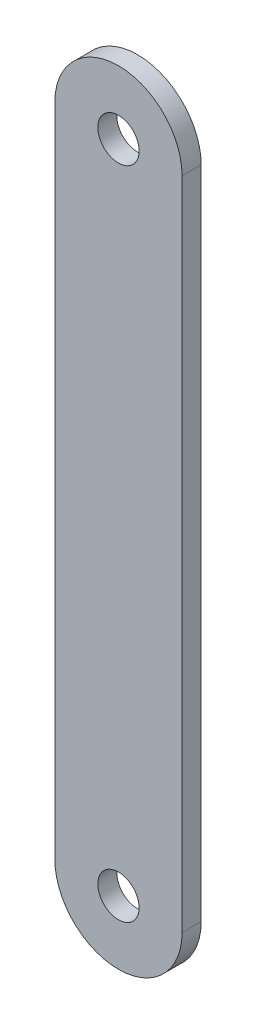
from build123d import *

# Parameters (mm, degrees)
SKETCH1_R      = 3.25
EXTRUDE1_DEPTH = 3


with BuildPart() as part:
    # Sketch1 → Extrude1 (new body)
    with BuildSketch(Plane.XY):
        with BuildLine():
            Line((10, 0), (10, 103))
            ThreePointArc((10, 103), (0, 113), (-10, 103))
            Line((-10, 103), (-10, 0))
            ThreePointArc((-10, 0), (0, -10), (10, 0))
        make_face()
        with Locations((0, 103)):
            Circle(SKETCH1_R, mode=Mode.SUBTRACT)
        Circle(SKETCH1_R, mode=Mode.SUBTRACT)
    extrude(amount=EXTRUDE1_DEPTH)


solid = part.part
